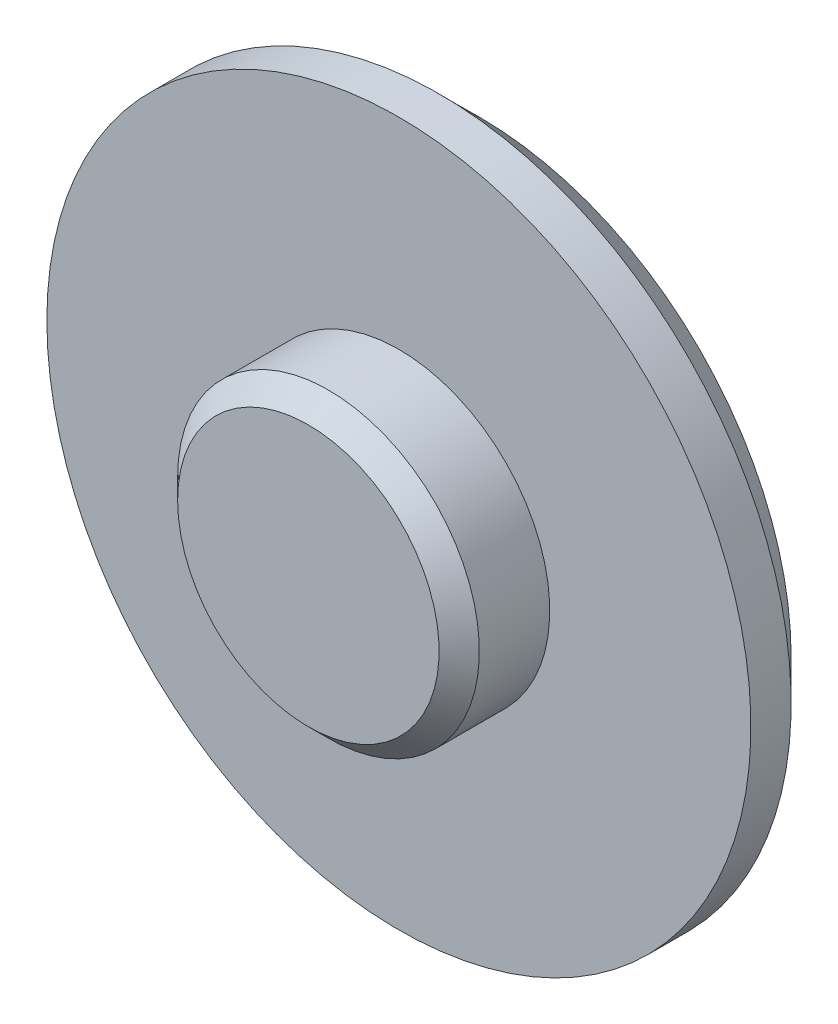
from build123d import *


with BuildPart() as part:
    # Sketch 1 → Revolve 1 (revolve)
    with BuildSketch(Plane.XZ, mode=Mode.PRIVATE) as revolve_1_sk:
        Polygon((6.5, 8.5), (0, 8.5), (0, 0), (15.5, 0), (17.5, 2), (17.5, 4), (7.5, 4), (7.5, 7.5), align=None)
    revolve(revolve_1_sk.sketch.rotate(Axis((0, 0, 8.5), (0, 0, -1)), 180), axis=Axis((0, 0, 8.5), (0, 0, -1)))


solid = part.part
